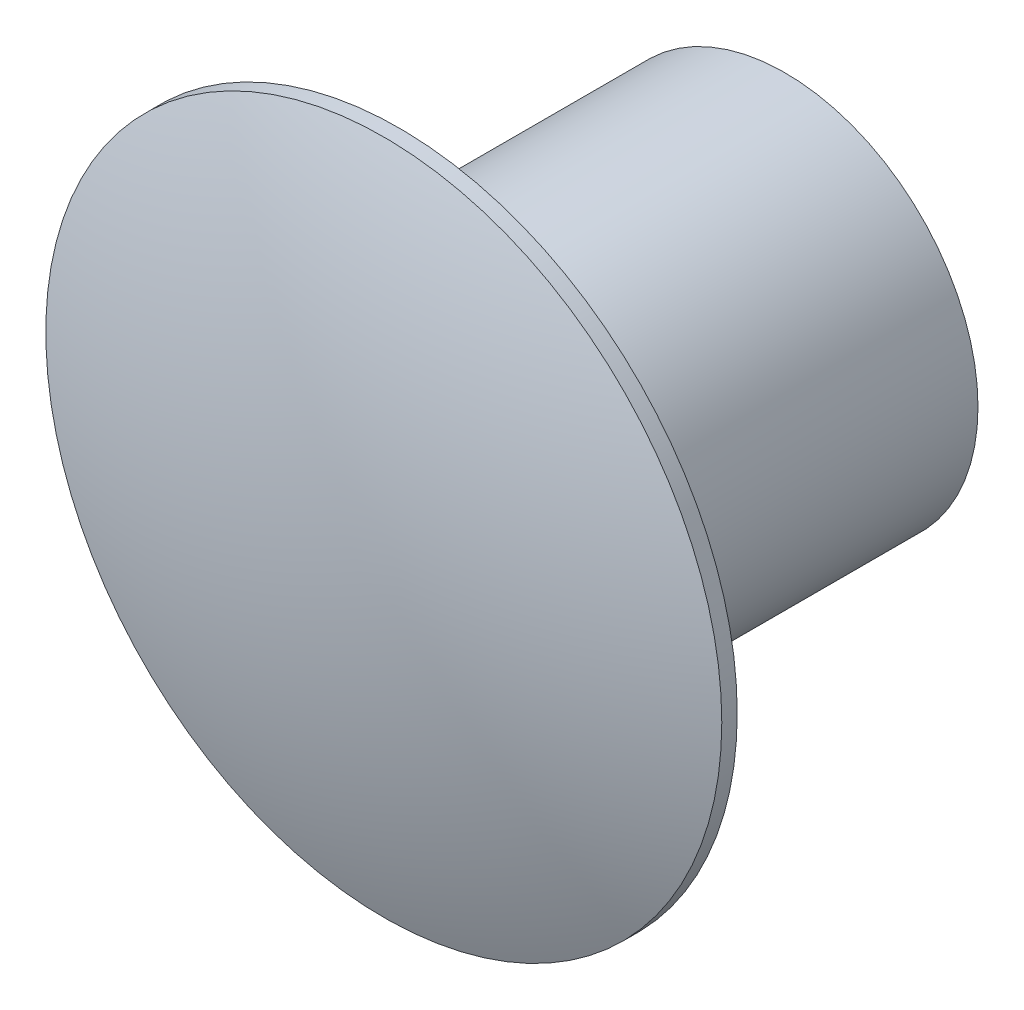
from build123d import *

# Parameters (mm, degrees)
SKETCH1_R           = 1.5875
BOSS_EXTRUDE1_DEPTH = 3.175
SKETCH2_R           = 2.7813
BOSS_EXTRUDE2_DEPTH = 0.127
DOME1_FACE_RADIUS   = 2.7813
DOME1_HEIGHT        = 0.508
SKETCH3_R           = 1.201530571
CUT_EXTRUDE1_DEPTH  = 0.508


with BuildPart() as part:
    # Sketch1 → Boss-Extrude1 (new body)
    with BuildSketch(Plane.XY):
        Circle(SKETCH1_R)
    extrude(amount=-BOSS_EXTRUDE1_DEPTH)

    # Sketch2 → Boss-Extrude2 (add)
    with BuildSketch(Plane.XY):
        Circle(SKETCH2_R)
    extrude(amount=BOSS_EXTRUDE2_DEPTH)

    # Dome1: a dome of height H over a round flat face of radius A is a cap of a sphere of radius (A * A + H * H) / (2 * H)
    dome1_r = (DOME1_FACE_RADIUS * DOME1_FACE_RADIUS + DOME1_HEIGHT * DOME1_HEIGHT) / (2 * DOME1_HEIGHT)
    dome1_base = Plane((0, 0, 0.127), z_dir=(0, 0, 1))
    with Locations(dome1_base.offset(DOME1_HEIGHT - dome1_r)):
        dome1_ball = Sphere(dome1_r, mode=Mode.PRIVATE)
    add(split(dome1_ball, bisect_by=dome1_base, keep=Keep.TOP, mode=Mode.PRIVATE))

    # Sketch3 → Cut-Extrude1 (cut)
    with BuildSketch(Plane(origin=(0, 0, -3.175), x_dir=(-1, 0, 0), z_dir=(0, 0, -1))):
        Circle(SKETCH3_R)
    extrude(amount=-CUT_EXTRUDE1_DEPTH, mode=Mode.SUBTRACT)


solid = part.part
